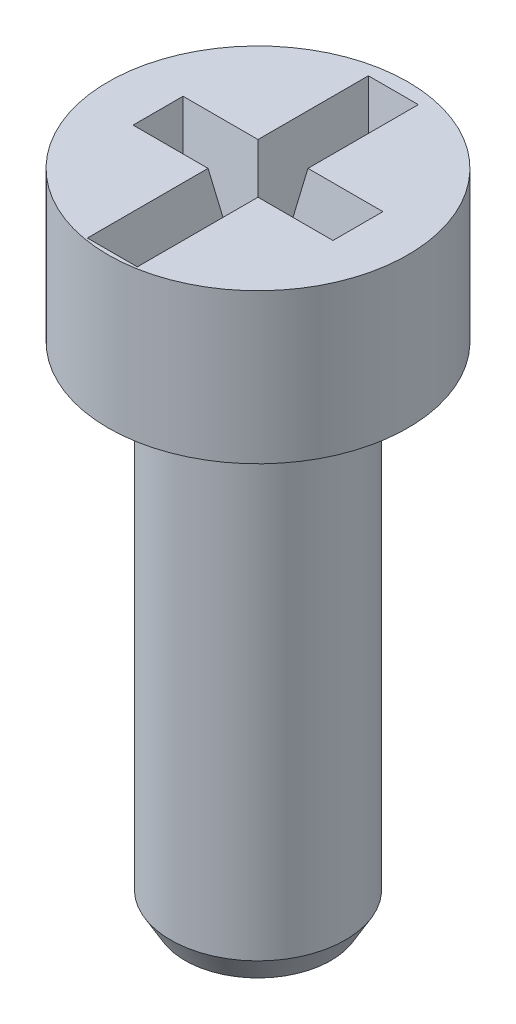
ISO-10303-21;
HEADER;
FILE_DESCRIPTION(('STEP AP214'),'2;1');
FILE_NAME('part.step','',(''),(''),'','','');
FILE_SCHEMA(('AUTOMOTIVE_DESIGN { 1 0 10303 214 1 1 1 1 }'));
ENDSEC;
DATA;
#1=APPLICATION_CONTEXT('core data for automotive mechanical design processes');
#2=APPLICATION_PROTOCOL_DEFINITION('international standard','automotive_design',2000,#1);
#3=PRODUCT_CONTEXT('',#1,'mechanical');
#4=PRODUCT('Part','Part','',(#3));
#5=PRODUCT_RELATED_PRODUCT_CATEGORY('part','',(#4));
#6=PRODUCT_DEFINITION_FORMATION('','',#4);
#7=PRODUCT_DEFINITION_CONTEXT('part definition',#1,'design');
#8=PRODUCT_DEFINITION('design','',#6,#7);
#9=PRODUCT_DEFINITION_SHAPE('','',#8);
#10=(LENGTH_UNIT() NAMED_UNIT(*) SI_UNIT(.MILLI.,.METRE.));
#11=(NAMED_UNIT(*) PLANE_ANGLE_UNIT() SI_UNIT($,.RADIAN.));
#12=(NAMED_UNIT(*) SI_UNIT($,.STERADIAN.) SOLID_ANGLE_UNIT());
#13=UNCERTAINTY_MEASURE_WITH_UNIT(LENGTH_MEASURE(1.E-05),#10,'distance_accuracy_value','');
#14=(GEOMETRIC_REPRESENTATION_CONTEXT(3) GLOBAL_UNCERTAINTY_ASSIGNED_CONTEXT((#13)) GLOBAL_UNIT_ASSIGNED_CONTEXT((#10,
#11,#12)) REPRESENTATION_CONTEXT('',''));
#15=CARTESIAN_POINT('',(0.,0.,0.));
#16=DIRECTION('',(0.,0.,1.));
#17=DIRECTION('',(1.,0.,0.));
#18=AXIS2_PLACEMENT_3D('',#15,#16,#17);
#19=CARTESIAN_POINT('',(3.,13.,0.));
#20=DIRECTION('',(0.,1.,0.));
#21=DIRECTION('',(0.,0.,1.));
#22=AXIS2_PLACEMENT_3D('',#19,#20,#21);
#23=PLANE('',#22);
#24=DIRECTION('',(0.,0.,-1.));
#25=VECTOR('',#24,1.);
#26=CARTESIAN_POINT('',(0.5,13.,-2.70897832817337));
#27=LINE('',#26,#25);
#28=CARTESIAN_POINT('',(0.5,13.,-0.5));
#29=VERTEX_POINT('',#28);
#30=CARTESIAN_POINT('',(0.5,13.,-2.70897832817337));
#31=VERTEX_POINT('',#30);
#32=EDGE_CURVE('E40',#29,#31,#27,.T.);
#33=ORIENTED_EDGE('',*,*,#32,.F.);
#34=DIRECTION('',(-1.,0.,0.));
#35=VECTOR('',#34,1.);
#36=CARTESIAN_POINT('',(2.,13.,-0.5));
#37=LINE('',#36,#35);
#38=CARTESIAN_POINT('',(2.,13.,-0.5));
#39=VERTEX_POINT('',#38);
#40=EDGE_CURVE('E164',#39,#29,#37,.T.);
#41=ORIENTED_EDGE('',*,*,#40,.F.);
#42=DIRECTION('',(0.,0.,-1.));
#43=VECTOR('',#42,1.);
#44=CARTESIAN_POINT('',(2.,13.,-0.5));
#45=LINE('',#44,#43);
#46=CARTESIAN_POINT('',(2.,13.,0.5));
#47=VERTEX_POINT('',#46);
#48=EDGE_CURVE('E162',#47,#39,#45,.T.);
#49=ORIENTED_EDGE('',*,*,#48,.F.);
#50=DIRECTION('',(1.,0.,0.));
#51=VECTOR('',#50,1.);
#52=CARTESIAN_POINT('',(2.,13.,0.5));
#53=LINE('',#52,#51);
#54=CARTESIAN_POINT('',(0.5,13.,0.5));
#55=VERTEX_POINT('',#54);
#56=EDGE_CURVE('E159',#55,#47,#53,.T.);
#57=ORIENTED_EDGE('',*,*,#56,.F.);
#58=DIRECTION('',(0.,0.,-1.));
#59=VECTOR('',#58,1.);
#60=CARTESIAN_POINT('',(0.5,13.,0.5));
#61=LINE('',#60,#59);
#62=CARTESIAN_POINT('',(0.5,13.,2.91537667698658));
#63=VERTEX_POINT('',#62);
#64=EDGE_CURVE('E156',#63,#55,#61,.T.);
#65=ORIENTED_EDGE('',*,*,#64,.F.);
#66=DIRECTION('',(1.,0.,0.));
#67=VECTOR('',#66,1.);
#68=CARTESIAN_POINT('',(0.5,13.,2.91537667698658));
#69=LINE('',#68,#67);
#70=CARTESIAN_POINT('',(-0.5,13.,2.91537667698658));
#71=VERTEX_POINT('',#70);
#72=EDGE_CURVE('E153',#71,#63,#69,.T.);
#73=ORIENTED_EDGE('',*,*,#72,.F.);
#74=DIRECTION('',(0.,0.,1.));
#75=VECTOR('',#74,1.);
#76=CARTESIAN_POINT('',(-0.5,13.,0.5));
#77=LINE('',#76,#75);
#78=CARTESIAN_POINT('',(-0.5,13.,0.5));
#79=VERTEX_POINT('',#78);
#80=EDGE_CURVE('E150',#79,#71,#77,.T.);
#81=ORIENTED_EDGE('',*,*,#80,.F.);
#82=DIRECTION('',(1.,0.,0.));
#83=VECTOR('',#82,1.);
#84=CARTESIAN_POINT('',(-0.5,13.,0.5));
#85=LINE('',#84,#83);
#86=CARTESIAN_POINT('',(-2.,13.,0.500000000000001));
#87=VERTEX_POINT('',#86);
#88=EDGE_CURVE('E147',#87,#79,#85,.T.);
#89=ORIENTED_EDGE('',*,*,#88,.F.);
#90=DIRECTION('',(0.,0.,1.));
#91=VECTOR('',#90,1.);
#92=CARTESIAN_POINT('',(-2.,13.,-0.5));
#93=LINE('',#92,#91);
#94=CARTESIAN_POINT('',(-2.,13.,-0.5));
#95=VERTEX_POINT('',#94);
#96=EDGE_CURVE('E141',#95,#87,#93,.T.);
#97=ORIENTED_EDGE('',*,*,#96,.F.);
#98=DIRECTION('',(-1.,0.,0.));
#99=VECTOR('',#98,1.);
#100=CARTESIAN_POINT('',(-0.5,13.,-0.5));
#101=LINE('',#100,#99);
#102=CARTESIAN_POINT('',(-0.5,13.,-0.5));
#103=VERTEX_POINT('',#102);
#104=EDGE_CURVE('E139',#103,#95,#101,.T.);
#105=ORIENTED_EDGE('',*,*,#104,.F.);
#106=DIRECTION('',(0.,0.,1.));
#107=VECTOR('',#106,1.);
#108=CARTESIAN_POINT('',(-0.5,13.,-2.70897832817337));
#109=LINE('',#108,#107);
#110=CARTESIAN_POINT('',(-0.5,13.,-2.70897832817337));
#111=VERTEX_POINT('',#110);
#112=EDGE_CURVE('E123',#111,#103,#109,.T.);
#113=ORIENTED_EDGE('',*,*,#112,.F.);
#114=DIRECTION('',(-1.,0.,0.));
#115=VECTOR('',#114,1.);
#116=CARTESIAN_POINT('',(0.5,13.,-2.70897832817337));
#117=LINE('',#116,#115);
#118=EDGE_CURVE('E132',#31,#111,#117,.T.);
#119=ORIENTED_EDGE('',*,*,#118,.F.);
#120=EDGE_LOOP('',(#33,#41,#49,#57,#65,#73,#81,#89,#97,#105,#113,#119));
#121=FACE_BOUND('',#120,.T.);
#122=CARTESIAN_POINT('',(0.,13.,0.));
#123=DIRECTION('',(0.,-1.,0.));
#124=DIRECTION('',(0.,0.,-1.));
#125=AXIS2_PLACEMENT_3D('',#122,#123,#124);
#126=CIRCLE('',#125,3.);
#127=CARTESIAN_POINT('',(0.,13.,-3.));
#128=VERTEX_POINT('',#127);
#129=EDGE_CURVE('E223',#128,#128,#126,.T.);
#130=ORIENTED_EDGE('',*,*,#129,.F.);
#131=EDGE_LOOP('',(#130));
#132=FACE_BOUND('',#131,.T.);
#133=ADVANCED_FACE('F26',(#121,#132),#23,.T.);
#134=CARTESIAN_POINT('',(0.,0.,0.));
#135=DIRECTION('',(0.,-1.,0.));
#136=DIRECTION('',(0.,0.,-1.));
#137=AXIS2_PLACEMENT_3D('',#134,#135,#136);
#138=CYLINDRICAL_SURFACE('',#137,3.);
#139=ORIENTED_EDGE('',*,*,#129,.T.);
#140=EDGE_LOOP('',(#139));
#141=FACE_BOUND('',#140,.T.);
#142=CARTESIAN_POINT('',(0.,10.,0.));
#143=DIRECTION('',(0.,-1.,0.));
#144=DIRECTION('',(0.,0.,-1.));
#145=AXIS2_PLACEMENT_3D('',#142,#143,#144);
#146=CIRCLE('',#145,3.);
#147=CARTESIAN_POINT('',(0.,10.,-3.));
#148=VERTEX_POINT('',#147);
#149=EDGE_CURVE('E220',#148,#148,#146,.T.);
#150=ORIENTED_EDGE('',*,*,#149,.F.);
#151=EDGE_LOOP('',(#150));
#152=FACE_BOUND('',#151,.T.);
#153=ADVANCED_FACE('F246',(#141,#152),#138,.T.);
#154=CARTESIAN_POINT('',(1.75,10.,0.));
#155=DIRECTION('',(0.,-1.,0.));
#156=DIRECTION('',(0.,0.,-1.));
#157=AXIS2_PLACEMENT_3D('',#154,#155,#156);
#158=PLANE('',#157);
#159=ORIENTED_EDGE('',*,*,#149,.T.);
#160=EDGE_LOOP('',(#159));
#161=FACE_BOUND('',#160,.T.);
#162=CARTESIAN_POINT('',(0.,10.,0.));
#163=DIRECTION('',(0.,-1.,0.));
#164=DIRECTION('',(0.,0.,-1.));
#165=AXIS2_PLACEMENT_3D('',#162,#163,#164);
#166=CIRCLE('',#165,1.75);
#167=CARTESIAN_POINT('',(0.,10.,-1.75));
#168=VERTEX_POINT('',#167);
#169=EDGE_CURVE('E168',#168,#168,#166,.T.);
#170=ORIENTED_EDGE('',*,*,#169,.F.);
#171=EDGE_LOOP('',(#170));
#172=FACE_BOUND('',#171,.T.);
#173=ADVANCED_FACE('F250',(#161,#172),#158,.T.);
#174=CARTESIAN_POINT('',(0.,0.,0.));
#175=DIRECTION('',(0.,-1.,0.));
#176=DIRECTION('',(0.,0.,-1.));
#177=AXIS2_PLACEMENT_3D('',#174,#175,#176);
#178=CYLINDRICAL_SURFACE('',#177,1.75);
#179=CARTESIAN_POINT('',(0.,0.500000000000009,0.));
#180=DIRECTION('',(0.,-1.,0.));
#181=DIRECTION('',(0.,0.,-1.));
#182=AXIS2_PLACEMENT_3D('',#179,#180,#181);
#183=CIRCLE('',#182,1.75);
#184=CARTESIAN_POINT('',(0.,0.500000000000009,-1.75));
#185=VERTEX_POINT('',#184);
#186=EDGE_CURVE('E11',#185,#185,#183,.F.);
#187=ORIENTED_EDGE('',*,*,#186,.T.);
#188=EDGE_LOOP('',(#187));
#189=FACE_BOUND('',#188,.T.);
#190=ORIENTED_EDGE('',*,*,#169,.T.);
#191=EDGE_LOOP('',(#190));
#192=FACE_BOUND('',#191,.T.);
#193=ADVANCED_FACE('F242',(#189,#192),#178,.T.);
#194=CARTESIAN_POINT('',(0.,0.,0.));
#195=DIRECTION('',(0.,-1.,0.));
#196=DIRECTION('',(0.,0.,-1.));
#197=AXIS2_PLACEMENT_3D('',#194,#195,#196);
#198=PLANE('',#197);
#199=CARTESIAN_POINT('',(0.,0.,0.));
#200=DIRECTION('',(0.,-1.,0.));
#201=DIRECTION('',(0.,0.,-1.));
#202=AXIS2_PLACEMENT_3D('',#199,#200,#201);
#203=CIRCLE('',#202,1.46132486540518);
#204=CARTESIAN_POINT('',(0.,0.,-1.46132486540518));
#205=VERTEX_POINT('',#204);
#206=EDGE_CURVE('E33',#205,#205,#203,.T.);
#207=ORIENTED_EDGE('',*,*,#206,.T.);
#208=EDGE_LOOP('',(#207));
#209=FACE_BOUND('',#208,.T.);
#210=ADVANCED_FACE('F228',(#209),#198,.T.);
#211=CARTESIAN_POINT('',(0.,0.,0.));
#212=DIRECTION('',(0.,1.,0.));
#213=DIRECTION('',(0.,0.,1.));
#214=AXIS2_PLACEMENT_3D('',#211,#212,#213);
#215=CONICAL_SURFACE('',#214,1.46132486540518,0.523598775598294);
#216=ORIENTED_EDGE('',*,*,#186,.F.);
#217=EDGE_LOOP('',(#216));
#218=FACE_BOUND('',#217,.T.);
#219=ORIENTED_EDGE('',*,*,#206,.F.);
#220=EDGE_LOOP('',(#219));
#221=FACE_BOUND('',#220,.T.);
#222=ADVANCED_FACE('F230',(#218,#221),#215,.T.);
#223=CARTESIAN_POINT('',(0.5,13.,-2.70897832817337));
#224=DIRECTION('',(0.984807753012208,-0.173648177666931,0.));
#225=DIRECTION('',(0.173648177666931,0.984807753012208,0.));
#226=AXIS2_PLACEMENT_3D('',#223,#224,#225);
#227=PLANE('',#226);
#228=ORIENTED_EDGE('',*,*,#32,.T.);
#229=DIRECTION('',(0.171087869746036,0.970287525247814,-0.171087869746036));
#230=VECTOR('',#229,1.);
#231=CARTESIAN_POINT('',(0.5,13.,-2.70897832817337));
#232=LINE('',#231,#230);
#233=CARTESIAN_POINT('',(0.235509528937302,11.5,-2.44448785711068));
#234=VERTEX_POINT('',#233);
#235=EDGE_CURVE('E83',#234,#31,#232,.T.);
#236=ORIENTED_EDGE('',*,*,#235,.F.);
#237=DIRECTION('',(0.,0.,-1.));
#238=VECTOR('',#237,1.);
#239=CARTESIAN_POINT('',(0.235509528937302,11.5,-2.70897832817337));
#240=LINE('',#239,#238);
#241=CARTESIAN_POINT('',(0.235509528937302,11.5,-0.235509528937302));
#242=VERTEX_POINT('',#241);
#243=EDGE_CURVE('E166',#242,#234,#240,.T.);
#244=ORIENTED_EDGE('',*,*,#243,.F.);
#245=DIRECTION('',(0.171087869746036,0.970287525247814,-0.171087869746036));
#246=VECTOR('',#245,1.);
#247=CARTESIAN_POINT('',(0.564659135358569,13.3667001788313,-0.564659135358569));
#248=LINE('',#247,#246);
#249=EDGE_CURVE('E48',#242,#29,#248,.T.);
#250=ORIENTED_EDGE('',*,*,#249,.T.);
#251=EDGE_LOOP('',(#228,#236,#244,#250));
#252=FACE_BOUND('',#251,.T.);
#253=ADVANCED_FACE('F232',(#252),#227,.F.);
#254=CARTESIAN_POINT('',(2.,13.,-0.5));
#255=DIRECTION('',(0.,-0.173648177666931,-0.984807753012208));
#256=DIRECTION('',(0.,0.984807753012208,-0.173648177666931));
#257=AXIS2_PLACEMENT_3D('',#254,#255,#256);
#258=PLANE('',#257);
#259=ORIENTED_EDGE('',*,*,#40,.T.);
#260=ORIENTED_EDGE('',*,*,#249,.F.);
#261=DIRECTION('',(-1.,0.,0.));
#262=VECTOR('',#261,1.);
#263=CARTESIAN_POINT('',(2.,11.5,-0.235509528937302));
#264=LINE('',#263,#262);
#265=CARTESIAN_POINT('',(1.7355095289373,11.5,-0.235509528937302));
#266=VERTEX_POINT('',#265);
#267=EDGE_CURVE('E169',#266,#242,#264,.T.);
#268=ORIENTED_EDGE('',*,*,#267,.F.);
#269=DIRECTION('',(0.171087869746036,0.970287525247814,-0.171087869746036));
#270=VECTOR('',#269,1.);
#271=CARTESIAN_POINT('',(2.,13.,-0.5));
#272=LINE('',#271,#270);
#273=EDGE_CURVE('E88',#266,#39,#272,.T.);
#274=ORIENTED_EDGE('',*,*,#273,.T.);
#275=EDGE_LOOP('',(#259,#260,#268,#274));
#276=FACE_BOUND('',#275,.T.);
#277=ADVANCED_FACE('F240',(#276),#258,.F.);
#278=CARTESIAN_POINT('',(2.,13.,-0.5));
#279=DIRECTION('',(0.984807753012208,-0.173648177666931,0.));
#280=DIRECTION('',(0.173648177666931,0.984807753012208,0.));
#281=AXIS2_PLACEMENT_3D('',#278,#279,#280);
#282=PLANE('',#281);
#283=ORIENTED_EDGE('',*,*,#48,.T.);
#284=ORIENTED_EDGE('',*,*,#273,.F.);
#285=DIRECTION('',(0.,0.,-1.));
#286=VECTOR('',#285,1.);
#287=CARTESIAN_POINT('',(1.7355095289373,11.5,-0.5));
#288=LINE('',#287,#286);
#289=CARTESIAN_POINT('',(1.7355095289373,11.5,0.235509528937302));
#290=VERTEX_POINT('',#289);
#291=EDGE_CURVE('E192',#290,#266,#288,.T.);
#292=ORIENTED_EDGE('',*,*,#291,.F.);
#293=DIRECTION('',(0.171087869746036,0.970287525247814,0.171087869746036));
#294=VECTOR('',#293,1.);
#295=CARTESIAN_POINT('',(2.,13.,0.5));
#296=LINE('',#295,#294);
#297=EDGE_CURVE('E184',#290,#47,#296,.T.);
#298=ORIENTED_EDGE('',*,*,#297,.T.);
#299=EDGE_LOOP('',(#283,#284,#292,#298));
#300=FACE_BOUND('',#299,.T.);
#301=ADVANCED_FACE('F285',(#300),#282,.F.);
#302=CARTESIAN_POINT('',(2.,13.,0.5));
#303=DIRECTION('',(0.,-0.173648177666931,0.984807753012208));
#304=DIRECTION('',(0.,-0.984807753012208,-0.173648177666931));
#305=AXIS2_PLACEMENT_3D('',#302,#303,#304);
#306=PLANE('',#305);
#307=ORIENTED_EDGE('',*,*,#56,.T.);
#308=ORIENTED_EDGE('',*,*,#297,.F.);
#309=DIRECTION('',(1.,0.,0.));
#310=VECTOR('',#309,1.);
#311=CARTESIAN_POINT('',(2.,11.5,0.235509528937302));
#312=LINE('',#311,#310);
#313=CARTESIAN_POINT('',(0.235509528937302,11.5,0.235509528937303));
#314=VERTEX_POINT('',#313);
#315=EDGE_CURVE('E195',#314,#290,#312,.T.);
#316=ORIENTED_EDGE('',*,*,#315,.F.);
#317=DIRECTION('',(0.171087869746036,0.970287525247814,0.171087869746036));
#318=VECTOR('',#317,1.);
#319=CARTESIAN_POINT('',(0.543906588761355,13.2490066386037,0.543906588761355));
#320=LINE('',#319,#318);
#321=EDGE_CURVE('E182',#314,#55,#320,.T.);
#322=ORIENTED_EDGE('',*,*,#321,.T.);
#323=EDGE_LOOP('',(#307,#308,#316,#322));
#324=FACE_BOUND('',#323,.T.);
#325=ADVANCED_FACE('F291',(#324),#306,.F.);
#326=CARTESIAN_POINT('',(0.5,13.,0.5));
#327=DIRECTION('',(0.984807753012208,-0.173648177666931,0.));
#328=DIRECTION('',(0.173648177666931,0.984807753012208,0.));
#329=AXIS2_PLACEMENT_3D('',#326,#327,#328);
#330=PLANE('',#329);
#331=ORIENTED_EDGE('',*,*,#64,.T.);
#332=ORIENTED_EDGE('',*,*,#321,.F.);
#333=DIRECTION('',(0.,0.,-1.));
#334=VECTOR('',#333,1.);
#335=CARTESIAN_POINT('',(0.235509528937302,11.5,0.5));
#336=LINE('',#335,#334);
#337=CARTESIAN_POINT('',(0.235509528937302,11.5,2.65088620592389));
#338=VERTEX_POINT('',#337);
#339=EDGE_CURVE('E198',#338,#314,#336,.T.);
#340=ORIENTED_EDGE('',*,*,#339,.F.);
#341=DIRECTION('',(0.171087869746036,0.970287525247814,0.171087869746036));
#342=VECTOR('',#341,1.);
#343=CARTESIAN_POINT('',(0.5,13.,2.91537667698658));
#344=LINE('',#343,#342);
#345=EDGE_CURVE('E180',#338,#63,#344,.T.);
#346=ORIENTED_EDGE('',*,*,#345,.T.);
#347=EDGE_LOOP('',(#331,#332,#340,#346));
#348=FACE_BOUND('',#347,.T.);
#349=ADVANCED_FACE('F299',(#348),#330,.F.);
#350=CARTESIAN_POINT('',(0.5,13.,2.91537667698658));
#351=DIRECTION('',(0.,-0.173648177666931,0.984807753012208));
#352=DIRECTION('',(0.,-0.984807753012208,-0.173648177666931));
#353=AXIS2_PLACEMENT_3D('',#350,#351,#352);
#354=PLANE('',#353);
#355=ORIENTED_EDGE('',*,*,#72,.T.);
#356=ORIENTED_EDGE('',*,*,#345,.F.);
#357=DIRECTION('',(1.,0.,0.));
#358=VECTOR('',#357,1.);
#359=CARTESIAN_POINT('',(0.5,11.5,2.65088620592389));
#360=LINE('',#359,#358);
#361=CARTESIAN_POINT('',(-0.235509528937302,11.5,2.65088620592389));
#362=VERTEX_POINT('',#361);
#363=EDGE_CURVE('E201',#362,#338,#360,.T.);
#364=ORIENTED_EDGE('',*,*,#363,.F.);
#365=DIRECTION('',(-0.171087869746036,0.970287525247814,0.171087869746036));
#366=VECTOR('',#365,1.);
#367=CARTESIAN_POINT('',(-0.429299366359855,12.5990367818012,2.84467604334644));
#368=LINE('',#367,#366);
#369=EDGE_CURVE('E178',#362,#71,#368,.T.);
#370=ORIENTED_EDGE('',*,*,#369,.T.);
#371=EDGE_LOOP('',(#355,#356,#364,#370));
#372=FACE_BOUND('',#371,.T.);
#373=ADVANCED_FACE('F307',(#372),#354,.F.);
#374=CARTESIAN_POINT('',(-0.5,13.,0.5));
#375=DIRECTION('',(-0.984807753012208,-0.173648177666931,0.));
#376=DIRECTION('',(0.173648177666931,-0.984807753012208,0.));
#377=AXIS2_PLACEMENT_3D('',#374,#375,#376);
#378=PLANE('',#377);
#379=ORIENTED_EDGE('',*,*,#80,.T.);
#380=ORIENTED_EDGE('',*,*,#369,.F.);
#381=DIRECTION('',(0.,0.,1.));
#382=VECTOR('',#381,1.);
#383=CARTESIAN_POINT('',(-0.235509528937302,11.5,0.5));
#384=LINE('',#383,#382);
#385=CARTESIAN_POINT('',(-0.235509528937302,11.5,0.235509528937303));
#386=VERTEX_POINT('',#385);
#387=EDGE_CURVE('E204',#386,#362,#384,.T.);
#388=ORIENTED_EDGE('',*,*,#387,.F.);
#389=DIRECTION('',(-0.171087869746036,0.970287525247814,0.171087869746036));
#390=VECTOR('',#389,1.);
#391=CARTESIAN_POINT('',(-0.5,13.,0.5));
#392=LINE('',#391,#390);
#393=EDGE_CURVE('E176',#386,#79,#392,.T.);
#394=ORIENTED_EDGE('',*,*,#393,.T.);
#395=EDGE_LOOP('',(#379,#380,#388,#394));
#396=FACE_BOUND('',#395,.T.);
#397=ADVANCED_FACE('F315',(#396),#378,.F.);
#398=CARTESIAN_POINT('',(-0.5,13.,0.5));
#399=DIRECTION('',(0.,-0.173648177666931,0.984807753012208));
#400=DIRECTION('',(0.,-0.984807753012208,-0.173648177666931));
#401=AXIS2_PLACEMENT_3D('',#398,#399,#400);
#402=PLANE('',#401);
#403=ORIENTED_EDGE('',*,*,#88,.T.);
#404=ORIENTED_EDGE('',*,*,#393,.F.);
#405=DIRECTION('',(1.,0.,0.));
#406=VECTOR('',#405,1.);
#407=CARTESIAN_POINT('',(-0.5,11.5,0.235509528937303));
#408=LINE('',#407,#406);
#409=CARTESIAN_POINT('',(-1.7355095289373,11.5,0.235509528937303));
#410=VERTEX_POINT('',#409);
#411=EDGE_CURVE('E207',#410,#386,#408,.T.);
#412=ORIENTED_EDGE('',*,*,#411,.F.);
#413=DIRECTION('',(-0.171087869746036,0.970287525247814,0.171087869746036));
#414=VECTOR('',#413,1.);
#415=CARTESIAN_POINT('',(-1.97072894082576,12.8339955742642,0.470728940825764));
#416=LINE('',#415,#414);
#417=EDGE_CURVE('E174',#410,#87,#416,.T.);
#418=ORIENTED_EDGE('',*,*,#417,.T.);
#419=EDGE_LOOP('',(#403,#404,#412,#418));
#420=FACE_BOUND('',#419,.T.);
#421=ADVANCED_FACE('F323',(#420),#402,.F.);
#422=CARTESIAN_POINT('',(-2.,13.,-0.5));
#423=DIRECTION('',(-0.984807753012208,-0.173648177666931,0.));
#424=DIRECTION('',(0.173648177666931,-0.984807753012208,0.));
#425=AXIS2_PLACEMENT_3D('',#422,#423,#424);
#426=PLANE('',#425);
#427=ORIENTED_EDGE('',*,*,#96,.T.);
#428=ORIENTED_EDGE('',*,*,#417,.F.);
#429=DIRECTION('',(0.,0.,1.));
#430=VECTOR('',#429,1.);
#431=CARTESIAN_POINT('',(-1.7355095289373,11.5,-0.5));
#432=LINE('',#431,#430);
#433=CARTESIAN_POINT('',(-1.7355095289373,11.5,-0.235509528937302));
#434=VERTEX_POINT('',#433);
#435=EDGE_CURVE('E210',#434,#410,#432,.T.);
#436=ORIENTED_EDGE('',*,*,#435,.F.);
#437=DIRECTION('',(-0.171087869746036,0.970287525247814,-0.171087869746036));
#438=VECTOR('',#437,1.);
#439=CARTESIAN_POINT('',(-1.95609341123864,12.7509933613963,-0.456093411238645));
#440=LINE('',#439,#438);
#441=EDGE_CURVE('E172',#434,#95,#440,.T.);
#442=ORIENTED_EDGE('',*,*,#441,.T.);
#443=EDGE_LOOP('',(#427,#428,#436,#442));
#444=FACE_BOUND('',#443,.T.);
#445=ADVANCED_FACE('F331',(#444),#426,.F.);
#446=CARTESIAN_POINT('',(-0.5,13.,-0.5));
#447=DIRECTION('',(0.,-0.173648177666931,-0.984807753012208));
#448=DIRECTION('',(0.,0.984807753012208,-0.173648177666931));
#449=AXIS2_PLACEMENT_3D('',#446,#447,#448);
#450=PLANE('',#449);
#451=ORIENTED_EDGE('',*,*,#104,.T.);
#452=ORIENTED_EDGE('',*,*,#441,.F.);
#453=DIRECTION('',(-1.,0.,0.));
#454=VECTOR('',#453,1.);
#455=CARTESIAN_POINT('',(-0.5,11.5,-0.235509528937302));
#456=LINE('',#455,#454);
#457=CARTESIAN_POINT('',(-0.235509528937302,11.5,-0.235509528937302));
#458=VERTEX_POINT('',#457);
#459=EDGE_CURVE('E213',#458,#434,#456,.T.);
#460=ORIENTED_EDGE('',*,*,#459,.F.);
#461=DIRECTION('',(-0.171087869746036,0.970287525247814,-0.171087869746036));
#462=VECTOR('',#461,1.);
#463=CARTESIAN_POINT('',(-0.5,13.,-0.5));
#464=LINE('',#463,#462);
#465=EDGE_CURVE('E129',#458,#103,#464,.T.);
#466=ORIENTED_EDGE('',*,*,#465,.T.);
#467=EDGE_LOOP('',(#451,#452,#460,#466));
#468=FACE_BOUND('',#467,.T.);
#469=ADVANCED_FACE('F339',(#468),#450,.F.);
#470=CARTESIAN_POINT('',(-0.5,13.,-2.70897832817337));
#471=DIRECTION('',(-0.984807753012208,-0.173648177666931,0.));
#472=DIRECTION('',(0.173648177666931,-0.984807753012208,0.));
#473=AXIS2_PLACEMENT_3D('',#470,#471,#472);
#474=PLANE('',#473);
#475=ORIENTED_EDGE('',*,*,#112,.T.);
#476=ORIENTED_EDGE('',*,*,#465,.F.);
#477=DIRECTION('',(0.,0.,1.));
#478=VECTOR('',#477,1.);
#479=CARTESIAN_POINT('',(-0.235509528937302,11.5,-2.70897832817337));
#480=LINE('',#479,#478);
#481=CARTESIAN_POINT('',(-0.235509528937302,11.5,-2.44448785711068));
#482=VERTEX_POINT('',#481);
#483=EDGE_CURVE('E126',#482,#458,#480,.T.);
#484=ORIENTED_EDGE('',*,*,#483,.F.);
#485=DIRECTION('',(-0.171087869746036,0.970287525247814,-0.171087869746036));
#486=VECTOR('',#485,1.);
#487=CARTESIAN_POINT('',(-0.470728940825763,12.8339955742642,-2.67970726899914));
#488=LINE('',#487,#486);
#489=EDGE_CURVE('E119',#482,#111,#488,.T.);
#490=ORIENTED_EDGE('',*,*,#489,.T.);
#491=EDGE_LOOP('',(#475,#476,#484,#490));
#492=FACE_BOUND('',#491,.T.);
#493=ADVANCED_FACE('F121',(#492),#474,.F.);
#494=CARTESIAN_POINT('',(0.5,13.,-2.70897832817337));
#495=DIRECTION('',(0.,-0.173648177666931,-0.984807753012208));
#496=DIRECTION('',(0.,0.984807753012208,-0.173648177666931));
#497=AXIS2_PLACEMENT_3D('',#494,#495,#496);
#498=PLANE('',#497);
#499=ORIENTED_EDGE('',*,*,#118,.T.);
#500=ORIENTED_EDGE('',*,*,#489,.F.);
#501=DIRECTION('',(-1.,0.,0.));
#502=VECTOR('',#501,1.);
#503=CARTESIAN_POINT('',(0.5,11.5,-2.44448785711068));
#504=LINE('',#503,#502);
#505=EDGE_CURVE('E189',#234,#482,#504,.T.);
#506=ORIENTED_EDGE('',*,*,#505,.F.);
#507=ORIENTED_EDGE('',*,*,#235,.T.);
#508=EDGE_LOOP('',(#499,#500,#506,#507));
#509=FACE_BOUND('',#508,.T.);
#510=ADVANCED_FACE('F133',(#509),#498,.F.);
#511=CARTESIAN_POINT('',(0.5,11.5,2.91537667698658));
#512=DIRECTION('',(0.,-1.,0.));
#513=DIRECTION('',(0.,0.,-1.));
#514=AXIS2_PLACEMENT_3D('',#511,#512,#513);
#515=PLANE('',#514);
#516=ORIENTED_EDGE('',*,*,#243,.T.);
#517=ORIENTED_EDGE('',*,*,#505,.T.);
#518=ORIENTED_EDGE('',*,*,#483,.T.);
#519=ORIENTED_EDGE('',*,*,#459,.T.);
#520=ORIENTED_EDGE('',*,*,#435,.T.);
#521=ORIENTED_EDGE('',*,*,#411,.T.);
#522=ORIENTED_EDGE('',*,*,#387,.T.);
#523=ORIENTED_EDGE('',*,*,#363,.T.);
#524=ORIENTED_EDGE('',*,*,#339,.T.);
#525=ORIENTED_EDGE('',*,*,#315,.T.);
#526=ORIENTED_EDGE('',*,*,#291,.T.);
#527=ORIENTED_EDGE('',*,*,#267,.T.);
#528=EDGE_LOOP('',(#516,#517,#518,#519,#520,#521,#522,#523,#524,#525,#526,#527));
#529=FACE_BOUND('',#528,.T.);
#530=ADVANCED_FACE('F360',(#529),#515,.F.);
#531=CLOSED_SHELL('',(#133,#153,#173,#193,#210,#222,#253,#277,#301,#325,#349,#373,#397,#421,
#445,#469,#493,#510,#530));
#532=MANIFOLD_SOLID_BREP('B2',#531);
#533=ADVANCED_BREP_SHAPE_REPRESENTATION('',(#18,#532),#14);
#534=SHAPE_DEFINITION_REPRESENTATION(#9,#533);
ENDSEC;
END-ISO-10303-21;
